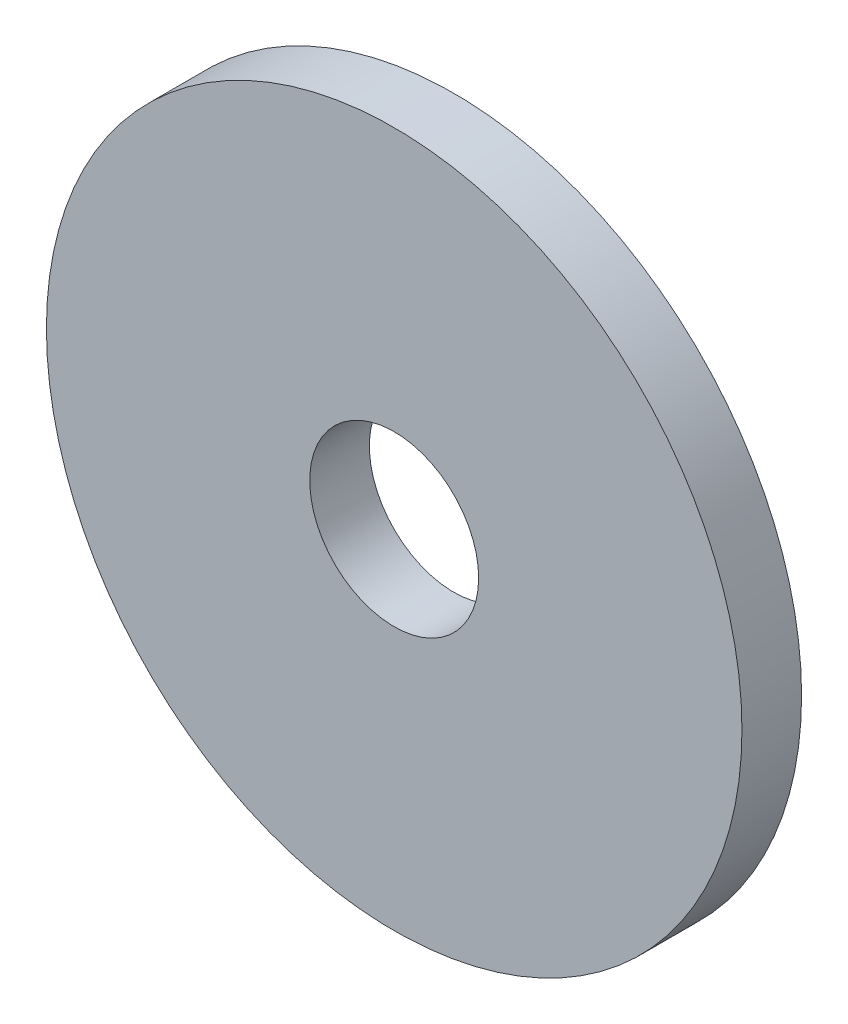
ISO-10303-21;
HEADER;
FILE_DESCRIPTION(('STEP AP214'),'2;1');
FILE_NAME('part.step','',(''),(''),'','','');
FILE_SCHEMA(('AUTOMOTIVE_DESIGN { 1 0 10303 214 1 1 1 1 }'));
ENDSEC;
DATA;
#1=APPLICATION_CONTEXT('core data for automotive mechanical design processes');
#2=APPLICATION_PROTOCOL_DEFINITION('international standard','automotive_design',2000,#1);
#3=PRODUCT_CONTEXT('',#1,'mechanical');
#4=PRODUCT('Part','Part','',(#3));
#5=PRODUCT_RELATED_PRODUCT_CATEGORY('part','',(#4));
#6=PRODUCT_DEFINITION_FORMATION('','',#4);
#7=PRODUCT_DEFINITION_CONTEXT('part definition',#1,'design');
#8=PRODUCT_DEFINITION('design','',#6,#7);
#9=PRODUCT_DEFINITION_SHAPE('','',#8);
#10=(LENGTH_UNIT() NAMED_UNIT(*) SI_UNIT(.MILLI.,.METRE.));
#11=(NAMED_UNIT(*) PLANE_ANGLE_UNIT() SI_UNIT($,.RADIAN.));
#12=(NAMED_UNIT(*) SI_UNIT($,.STERADIAN.) SOLID_ANGLE_UNIT());
#13=UNCERTAINTY_MEASURE_WITH_UNIT(LENGTH_MEASURE(1.E-05),#10,'distance_accuracy_value','');
#14=(GEOMETRIC_REPRESENTATION_CONTEXT(3) GLOBAL_UNCERTAINTY_ASSIGNED_CONTEXT((#13)) GLOBAL_UNIT_ASSIGNED_CONTEXT((#10,
#11,#12)) REPRESENTATION_CONTEXT('',''));
#15=CARTESIAN_POINT('',(0.,0.,0.));
#16=DIRECTION('',(0.,0.,1.));
#17=DIRECTION('',(1.,0.,0.));
#18=AXIS2_PLACEMENT_3D('',#15,#16,#17);
#19=CARTESIAN_POINT('',(0.,0.,6.));
#20=DIRECTION('',(0.,0.,1.));
#21=DIRECTION('',(1.,0.,0.));
#22=AXIS2_PLACEMENT_3D('',#19,#20,#21);
#23=PLANE('',#22);
#24=CARTESIAN_POINT('',(0.,0.,6.));
#25=DIRECTION('',(0.,0.,1.));
#26=DIRECTION('',(1.,0.,0.));
#27=AXIS2_PLACEMENT_3D('',#24,#25,#26);
#28=CIRCLE('',#27,35.);
#29=CARTESIAN_POINT('',(35.,0.,6.));
#30=VERTEX_POINT('',#29);
#31=EDGE_CURVE('E10',#30,#30,#28,.T.);
#32=ORIENTED_EDGE('',*,*,#31,.T.);
#33=EDGE_LOOP('',(#32));
#34=FACE_BOUND('',#33,.T.);
#35=CARTESIAN_POINT('',(0.,0.,6.));
#36=DIRECTION('',(0.,0.,1.));
#37=DIRECTION('',(1.,0.,0.));
#38=AXIS2_PLACEMENT_3D('',#35,#36,#37);
#39=CIRCLE('',#38,8.5);
#40=CARTESIAN_POINT('',(8.5,0.,6.));
#41=VERTEX_POINT('',#40);
#42=EDGE_CURVE('E40',#41,#41,#39,.T.);
#43=ORIENTED_EDGE('',*,*,#42,.F.);
#44=EDGE_LOOP('',(#43));
#45=FACE_BOUND('',#44,.T.);
#46=ADVANCED_FACE('F29',(#34,#45),#23,.T.);
#47=CARTESIAN_POINT('',(0.,0.,0.));
#48=DIRECTION('',(0.,0.,1.));
#49=DIRECTION('',(1.,0.,0.));
#50=AXIS2_PLACEMENT_3D('',#47,#48,#49);
#51=PLANE('',#50);
#52=CARTESIAN_POINT('',(0.,0.,0.));
#53=DIRECTION('',(0.,0.,1.));
#54=DIRECTION('',(1.,0.,0.));
#55=AXIS2_PLACEMENT_3D('',#52,#53,#54);
#56=CIRCLE('',#55,35.);
#57=CARTESIAN_POINT('',(35.,0.,0.));
#58=VERTEX_POINT('',#57);
#59=EDGE_CURVE('E36',#58,#58,#56,.T.);
#60=ORIENTED_EDGE('',*,*,#59,.F.);
#61=EDGE_LOOP('',(#60));
#62=FACE_BOUND('',#61,.T.);
#63=CARTESIAN_POINT('',(0.,0.,0.));
#64=DIRECTION('',(0.,0.,1.));
#65=DIRECTION('',(1.,0.,0.));
#66=AXIS2_PLACEMENT_3D('',#63,#64,#65);
#67=CIRCLE('',#66,8.5);
#68=CARTESIAN_POINT('',(8.5,0.,0.));
#69=VERTEX_POINT('',#68);
#70=EDGE_CURVE('E44',#69,#69,#67,.T.);
#71=ORIENTED_EDGE('',*,*,#70,.T.);
#72=EDGE_LOOP('',(#71));
#73=FACE_BOUND('',#72,.T.);
#74=ADVANCED_FACE('F50',(#62,#73),#51,.F.);
#75=CARTESIAN_POINT('',(0.,0.,6.));
#76=DIRECTION('',(0.,0.,-1.));
#77=DIRECTION('',(-1.,0.,0.));
#78=AXIS2_PLACEMENT_3D('',#75,#76,#77);
#79=CYLINDRICAL_SURFACE('',#78,35.);
#80=ORIENTED_EDGE('',*,*,#31,.F.);
#81=EDGE_LOOP('',(#80));
#82=FACE_BOUND('',#81,.T.);
#83=ORIENTED_EDGE('',*,*,#59,.T.);
#84=EDGE_LOOP('',(#83));
#85=FACE_BOUND('',#84,.T.);
#86=ADVANCED_FACE('F31',(#82,#85),#79,.T.);
#87=CARTESIAN_POINT('',(0.,0.,6.));
#88=DIRECTION('',(0.,0.,-1.));
#89=DIRECTION('',(-1.,0.,0.));
#90=AXIS2_PLACEMENT_3D('',#87,#88,#89);
#91=CYLINDRICAL_SURFACE('',#90,8.5);
#92=ORIENTED_EDGE('',*,*,#42,.T.);
#93=EDGE_LOOP('',(#92));
#94=FACE_BOUND('',#93,.T.);
#95=ORIENTED_EDGE('',*,*,#70,.F.);
#96=EDGE_LOOP('',(#95));
#97=FACE_BOUND('',#96,.T.);
#98=ADVANCED_FACE('F52',(#94,#97),#91,.F.);
#99=CLOSED_SHELL('',(#46,#74,#86,#98));
#100=MANIFOLD_SOLID_BREP('B2',#99);
#101=ADVANCED_BREP_SHAPE_REPRESENTATION('',(#18,#100),#14);
#102=SHAPE_DEFINITION_REPRESENTATION(#9,#101);
ENDSEC;
END-ISO-10303-21;
